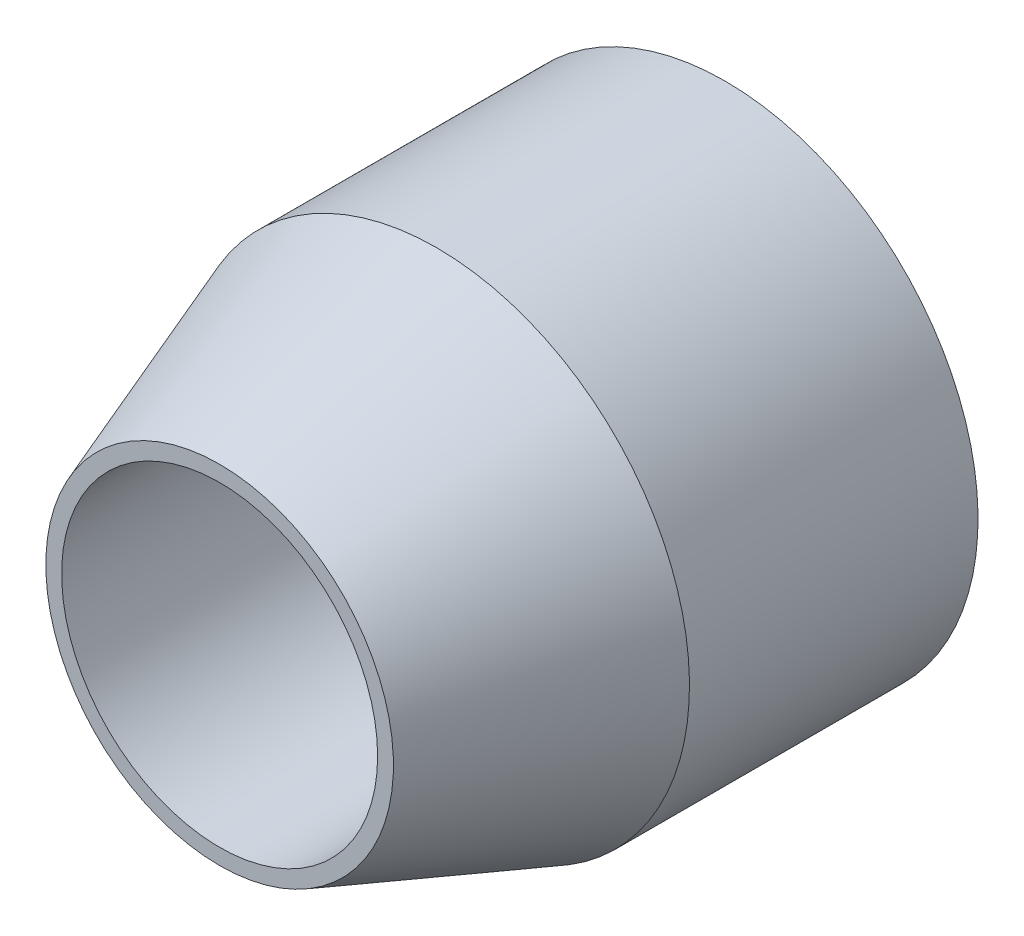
from build123d import *

# Parameters (mm, degrees)
F_5_16_0_3125_DIAMETER_HOLE1_D     = 7.9375
F_5_16_0_3125_DIAMETER_HOLE1_DEPTH = 6.35
F_5_16_0_3125_DIAMETER_HOLE1_TIP   = 2.384665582
CUT_EXTRUDE1_REACH                 = 17.554


with BuildPart() as part:
    # Sketch1 → Revolve1 (revolve)
    with BuildSketch(Plane(origin=(0, 0, 0), x_dir=(0, 0, -1), z_dir=(1, 0, 0))):
        Polygon((6.35, 0), (6.35, 6.35), (-0.897974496, 6.35), (-6.35, 4.365625), (-6.35, 0), align=None)
    revolve(axis=Axis((0, 0, -31.128920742), (0, 0, 1)))

    # 5_16 _0.3125_ Diameter Hole1
    with Locations(Plane(origin=(-0.35697535, 0.837771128, 6.35), x_dir=(-1, 0, 0), z_dir=(0, 0, 1))):
        with Locations((-0.35697535, 0.837771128)):
            Hole(F_5_16_0_3125_DIAMETER_HOLE1_D / 2, depth=F_5_16_0_3125_DIAMETER_HOLE1_DEPTH)
            with Locations((0, 0, -(F_5_16_0_3125_DIAMETER_HOLE1_DEPTH + F_5_16_0_3125_DIAMETER_HOLE1_TIP / 2))):  # 118° drill point
                Cone(0, F_5_16_0_3125_DIAMETER_HOLE1_D / 2, F_5_16_0_3125_DIAMETER_HOLE1_TIP, mode=Mode.SUBTRACT)

    # Sketch5 → Cut-Extrude1 (cut, up to next)
    with BuildSketch(Plane.XY.offset(-6.35), mode=Mode.PRIVATE) as cut_extrude1_sk1:
        Polygon((0, 3.96875), (-3.437038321, 1.984375), (-3.437038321, -1.984375), (0, -3.96875), (3.437038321, -1.984375), (3.437038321, 1.984375), align=None)
    cut_extrude1_tool1 = extrude(cut_extrude1_sk1.sketch, amount=CUT_EXTRUDE1_REACH, mode=Mode.PRIVATE) & part.part
    add(cut_extrude1_tool1.solids().sort_by_distance((0, 0, -6.35))[0], mode=Mode.SUBTRACT)


solid = part.part
